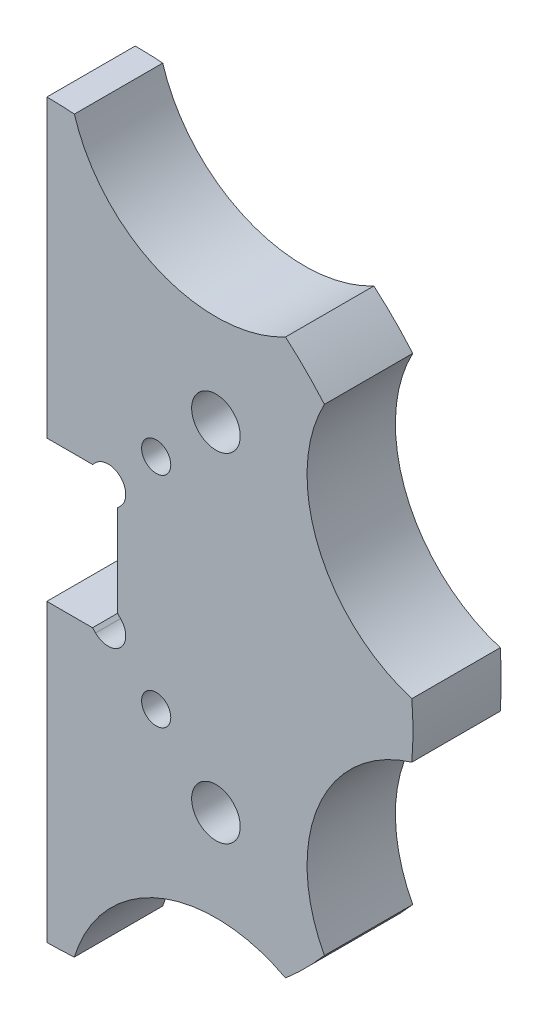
ISO-10303-21;
HEADER;
FILE_DESCRIPTION(('STEP AP214'),'2;1');
FILE_NAME('part.step','',(''),(''),'','','');
FILE_SCHEMA(('AUTOMOTIVE_DESIGN { 1 0 10303 214 1 1 1 1 }'));
ENDSEC;
DATA;
#1=APPLICATION_CONTEXT('core data for automotive mechanical design processes');
#2=APPLICATION_PROTOCOL_DEFINITION('international standard','automotive_design',2000,#1);
#3=PRODUCT_CONTEXT('',#1,'mechanical');
#4=PRODUCT('Part','Part','',(#3));
#5=PRODUCT_RELATED_PRODUCT_CATEGORY('part','',(#4));
#6=PRODUCT_DEFINITION_FORMATION('','',#4);
#7=PRODUCT_DEFINITION_CONTEXT('part definition',#1,'design');
#8=PRODUCT_DEFINITION('design','',#6,#7);
#9=PRODUCT_DEFINITION_SHAPE('','',#8);
#10=(LENGTH_UNIT() NAMED_UNIT(*) SI_UNIT(.MILLI.,.METRE.));
#11=(NAMED_UNIT(*) PLANE_ANGLE_UNIT() SI_UNIT($,.RADIAN.));
#12=(NAMED_UNIT(*) SI_UNIT($,.STERADIAN.) SOLID_ANGLE_UNIT());
#13=UNCERTAINTY_MEASURE_WITH_UNIT(LENGTH_MEASURE(1.E-05),#10,'distance_accuracy_value','');
#14=(GEOMETRIC_REPRESENTATION_CONTEXT(3) GLOBAL_UNCERTAINTY_ASSIGNED_CONTEXT((#13)) GLOBAL_UNIT_ASSIGNED_CONTEXT((#10,
#11,#12)) REPRESENTATION_CONTEXT('',''));
#15=CARTESIAN_POINT('',(0.,0.,0.));
#16=DIRECTION('',(0.,0.,1.));
#17=DIRECTION('',(1.,0.,0.));
#18=AXIS2_PLACEMENT_3D('',#15,#16,#17);
#19=CARTESIAN_POINT('',(0.,0.,10.));
#20=DIRECTION('',(0.,0.,1.));
#21=DIRECTION('',(1.,0.,0.));
#22=AXIS2_PLACEMENT_3D('',#19,#20,#21);
#23=PLANE('',#22);
#24=DIRECTION('',(0.707106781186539,-0.707106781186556,0.));
#25=VECTOR('',#24,1.);
#26=CARTESIAN_POINT('',(5.51543289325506,-8.34386001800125,10.));
#27=LINE('',#26,#25);
#28=CARTESIAN_POINT('',(5.17157287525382,-8.,10.));
#29=VERTEX_POINT('',#28);
#30=CARTESIAN_POINT('',(5.51543289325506,-8.34386001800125,10.));
#31=VERTEX_POINT('',#30);
#32=EDGE_CURVE('E192',#29,#31,#27,.T.);
#33=ORIENTED_EDGE('',*,*,#32,.F.);
#34=DIRECTION('',(-1.,0.,0.));
#35=VECTOR('',#34,1.);
#36=CARTESIAN_POINT('',(0.,-8.,10.));
#37=LINE('',#36,#35);
#38=CARTESIAN_POINT('',(0.,-8.,10.));
#39=VERTEX_POINT('',#38);
#40=EDGE_CURVE('E258',#29,#39,#37,.T.);
#41=ORIENTED_EDGE('',*,*,#40,.T.);
#42=DIRECTION('',(0.,-1.,0.));
#43=VECTOR('',#42,1.);
#44=CARTESIAN_POINT('',(0.,-8.,10.));
#45=LINE('',#44,#43);
#46=CARTESIAN_POINT('',(0.,-41.4241092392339,10.));
#47=VERTEX_POINT('',#46);
#48=EDGE_CURVE('E261',#39,#47,#45,.T.);
#49=ORIENTED_EDGE('',*,*,#48,.T.);
#50=CARTESIAN_POINT('',(0.,0.,10.));
#51=DIRECTION('',(0.,0.,1.));
#52=DIRECTION('',(1.,0.,0.));
#53=AXIS2_PLACEMENT_3D('',#50,#51,#52);
#54=CIRCLE('',#53,41.4241092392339);
#55=CARTESIAN_POINT('',(3.11294377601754,-41.3069777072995,10.));
#56=VERTEX_POINT('',#55);
#57=EDGE_CURVE('E263',#47,#56,#54,.T.);
#58=ORIENTED_EDGE('',*,*,#57,.T.);
#59=CARTESIAN_POINT('',(19.1341716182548,-46.1939766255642,10.));
#60=DIRECTION('',(0.,0.,-1.));
#61=DIRECTION('',(1.,0.,0.));
#62=AXIS2_PLACEMENT_3D('',#59,#60,#61);
#63=CIRCLE('',#62,16.75);
#64=CARTESIAN_POINT('',(27.0072603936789,-31.4096277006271,10.));
#65=VERTEX_POINT('',#64);
#66=EDGE_CURVE('E265',#56,#65,#63,.T.);
#67=ORIENTED_EDGE('',*,*,#66,.T.);
#68=CARTESIAN_POINT('',(0.,0.,10.));
#69=DIRECTION('',(0.,0.,1.));
#70=DIRECTION('',(1.,0.,0.));
#71=AXIS2_PLACEMENT_3D('',#68,#69,#70);
#72=CIRCLE('',#71,41.4241092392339);
#73=CARTESIAN_POINT('',(31.4096277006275,-27.0072603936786,10.));
#74=VERTEX_POINT('',#73);
#75=EDGE_CURVE('E267',#65,#74,#72,.T.);
#76=ORIENTED_EDGE('',*,*,#75,.T.);
#77=CARTESIAN_POINT('',(46.1939766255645,-19.1341716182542,10.));
#78=DIRECTION('',(0.,0.,-1.));
#79=DIRECTION('',(1.,0.,0.));
#80=AXIS2_PLACEMENT_3D('',#77,#78,#79);
#81=CIRCLE('',#80,16.75);
#82=CARTESIAN_POINT('',(41.3069777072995,-3.11294377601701,10.));
#83=VERTEX_POINT('',#82);
#84=EDGE_CURVE('E269',#74,#83,#81,.T.);
#85=ORIENTED_EDGE('',*,*,#84,.T.);
#86=CARTESIAN_POINT('',(0.,0.,10.));
#87=DIRECTION('',(0.,0.,1.));
#88=DIRECTION('',(1.,0.,0.));
#89=AXIS2_PLACEMENT_3D('',#86,#87,#88);
#90=CIRCLE('',#89,41.4241092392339);
#91=CARTESIAN_POINT('',(41.3069777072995,3.11294377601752,10.));
#92=VERTEX_POINT('',#91);
#93=EDGE_CURVE('E271',#83,#92,#90,.T.);
#94=ORIENTED_EDGE('',*,*,#93,.T.);
#95=CARTESIAN_POINT('',(46.1939766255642,19.1341716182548,10.));
#96=DIRECTION('',(0.,0.,-1.));
#97=DIRECTION('',(1.,0.,0.));
#98=AXIS2_PLACEMENT_3D('',#95,#96,#97);
#99=CIRCLE('',#98,16.75);
#100=CARTESIAN_POINT('',(31.4096277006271,27.0072603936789,10.));
#101=VERTEX_POINT('',#100);
#102=EDGE_CURVE('E273',#92,#101,#99,.T.);
#103=ORIENTED_EDGE('',*,*,#102,.T.);
#104=CARTESIAN_POINT('',(0.,0.,10.));
#105=DIRECTION('',(0.,0.,1.));
#106=DIRECTION('',(1.,0.,0.));
#107=AXIS2_PLACEMENT_3D('',#104,#105,#106);
#108=CIRCLE('',#107,41.4241092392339);
#109=CARTESIAN_POINT('',(27.0072603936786,31.4096277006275,10.));
#110=VERTEX_POINT('',#109);
#111=EDGE_CURVE('E275',#101,#110,#108,.T.);
#112=ORIENTED_EDGE('',*,*,#111,.T.);
#113=CARTESIAN_POINT('',(19.1341716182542,46.1939766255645,10.));
#114=DIRECTION('',(0.,0.,-1.));
#115=DIRECTION('',(1.,0.,0.));
#116=AXIS2_PLACEMENT_3D('',#113,#114,#115);
#117=CIRCLE('',#116,16.75);
#118=CARTESIAN_POINT('',(3.11294377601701,41.3069777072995,10.));
#119=VERTEX_POINT('',#118);
#120=EDGE_CURVE('E277',#110,#119,#117,.T.);
#121=ORIENTED_EDGE('',*,*,#120,.T.);
#122=CARTESIAN_POINT('',(0.,0.,10.));
#123=DIRECTION('',(0.,0.,1.));
#124=DIRECTION('',(1.,0.,0.));
#125=AXIS2_PLACEMENT_3D('',#122,#123,#124);
#126=CIRCLE('',#125,41.4241092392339);
#127=CARTESIAN_POINT('',(0.,41.4241092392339,10.));
#128=VERTEX_POINT('',#127);
#129=EDGE_CURVE('E279',#119,#128,#126,.T.);
#130=ORIENTED_EDGE('',*,*,#129,.T.);
#131=DIRECTION('',(0.,-1.,0.));
#132=VECTOR('',#131,1.);
#133=CARTESIAN_POINT('',(0.,41.4241092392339,10.));
#134=LINE('',#133,#132);
#135=CARTESIAN_POINT('',(0.,8.,10.));
#136=VERTEX_POINT('',#135);
#137=EDGE_CURVE('E281',#128,#136,#134,.T.);
#138=ORIENTED_EDGE('',*,*,#137,.T.);
#139=DIRECTION('',(1.,0.,0.));
#140=VECTOR('',#139,1.);
#141=CARTESIAN_POINT('',(0.,8.,10.));
#142=LINE('',#141,#140);
#143=CARTESIAN_POINT('',(5.17157287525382,8.,10.));
#144=VERTEX_POINT('',#143);
#145=EDGE_CURVE('E283',#136,#144,#142,.T.);
#146=ORIENTED_EDGE('',*,*,#145,.T.);
#147=DIRECTION('',(-0.707106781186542,-0.707106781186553,0.));
#148=VECTOR('',#147,1.);
#149=CARTESIAN_POINT('',(5.51543289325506,8.34386001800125,10.));
#150=LINE('',#149,#148);
#151=CARTESIAN_POINT('',(5.51543289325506,8.34386001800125,10.));
#152=VERTEX_POINT('',#151);
#153=EDGE_CURVE('E56',#152,#144,#150,.T.);
#154=ORIENTED_EDGE('',*,*,#153,.F.);
#155=CARTESIAN_POINT('',(6.92964645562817,6.92964645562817,10.));
#156=DIRECTION('',(0.,0.,1.));
#157=DIRECTION('',(1.,0.,0.));
#158=AXIS2_PLACEMENT_3D('',#155,#156,#157);
#159=CIRCLE('',#158,2.);
#160=CARTESIAN_POINT('',(8.34386001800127,5.51543289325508,10.));
#161=VERTEX_POINT('',#160);
#162=EDGE_CURVE('E203',#161,#152,#159,.T.);
#163=ORIENTED_EDGE('',*,*,#162,.F.);
#164=DIRECTION('',(0.707106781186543,0.707106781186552,0.));
#165=VECTOR('',#164,1.);
#166=CARTESIAN_POINT('',(8.34386001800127,5.51543289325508,10.));
#167=LINE('',#166,#165);
#168=CARTESIAN_POINT('',(8.00000000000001,5.17157287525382,10.));
#169=VERTEX_POINT('',#168);
#170=EDGE_CURVE('E211',#169,#161,#167,.T.);
#171=ORIENTED_EDGE('',*,*,#170,.F.);
#172=DIRECTION('',(0.,-1.,0.));
#173=VECTOR('',#172,1.);
#174=CARTESIAN_POINT('',(8.00000000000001,8.,10.));
#175=LINE('',#174,#173);
#176=CARTESIAN_POINT('',(8.00000000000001,-5.17157287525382,10.));
#177=VERTEX_POINT('',#176);
#178=EDGE_CURVE('E255',#169,#177,#175,.T.);
#179=ORIENTED_EDGE('',*,*,#178,.T.);
#180=DIRECTION('',(-0.707106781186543,0.707106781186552,0.));
#181=VECTOR('',#180,1.);
#182=CARTESIAN_POINT('',(8.34386001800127,-5.51543289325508,10.));
#183=LINE('',#182,#181);
#184=CARTESIAN_POINT('',(8.34386001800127,-5.51543289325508,10.));
#185=VERTEX_POINT('',#184);
#186=EDGE_CURVE('E195',#185,#177,#183,.T.);
#187=ORIENTED_EDGE('',*,*,#186,.F.);
#188=CARTESIAN_POINT('',(6.92964645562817,-6.92964645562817,10.));
#189=DIRECTION('',(0.,0.,1.));
#190=DIRECTION('',(-1.,0.,0.));
#191=AXIS2_PLACEMENT_3D('',#188,#189,#190);
#192=CIRCLE('',#191,2.);
#193=EDGE_CURVE('E176',#31,#185,#192,.T.);
#194=ORIENTED_EDGE('',*,*,#193,.F.);
#195=EDGE_LOOP('',(#33,#41,#49,#58,#67,#76,#85,#94,#103,#112,#121,#130,#138,#146,#154,#163,#171,
#179,#187,#194));
#196=FACE_BOUND('',#195,.T.);
#197=CARTESIAN_POINT('',(12.3743686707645,12.3743686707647,10.));
#198=DIRECTION('',(0.,0.,1.));
#199=DIRECTION('',(1.,0.,0.));
#200=AXIS2_PLACEMENT_3D('',#197,#198,#199);
#201=CIRCLE('',#200,1.65);
#202=CARTESIAN_POINT('',(14.0243686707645,12.3743686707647,10.));
#203=VERTEX_POINT('',#202);
#204=EDGE_CURVE('E225',#203,#203,#201,.T.);
#205=ORIENTED_EDGE('',*,*,#204,.F.);
#206=EDGE_LOOP('',(#205));
#207=FACE_BOUND('',#206,.T.);
#208=CARTESIAN_POINT('',(12.3743686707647,-12.3743686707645,10.));
#209=DIRECTION('',(0.,0.,1.));
#210=DIRECTION('',(1.,0.,0.));
#211=AXIS2_PLACEMENT_3D('',#208,#209,#210);
#212=CIRCLE('',#211,1.65);
#213=CARTESIAN_POINT('',(14.0243686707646,-12.3743686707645,10.));
#214=VERTEX_POINT('',#213);
#215=EDGE_CURVE('E236',#214,#214,#212,.T.);
#216=ORIENTED_EDGE('',*,*,#215,.F.);
#217=EDGE_LOOP('',(#216));
#218=FACE_BOUND('',#217,.T.);
#219=CARTESIAN_POINT('',(19.1341716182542,19.1341716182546,10.));
#220=DIRECTION('',(0.,0.,1.));
#221=DIRECTION('',(1.,0.,0.));
#222=AXIS2_PLACEMENT_3D('',#219,#220,#221);
#223=CIRCLE('',#222,2.75);
#224=CARTESIAN_POINT('',(21.8841716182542,19.1341716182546,10.));
#225=VERTEX_POINT('',#224);
#226=EDGE_CURVE('E249',#225,#225,#223,.T.);
#227=ORIENTED_EDGE('',*,*,#226,.F.);
#228=EDGE_LOOP('',(#227));
#229=FACE_BOUND('',#228,.T.);
#230=CARTESIAN_POINT('',(19.1341716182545,-19.1341716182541,10.));
#231=DIRECTION('',(0.,0.,1.));
#232=DIRECTION('',(1.,0.,0.));
#233=AXIS2_PLACEMENT_3D('',#230,#231,#232);
#234=CIRCLE('',#233,2.75);
#235=CARTESIAN_POINT('',(21.8841716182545,-19.1341716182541,10.));
#236=VERTEX_POINT('',#235);
#237=EDGE_CURVE('E243',#236,#236,#234,.T.);
#238=ORIENTED_EDGE('',*,*,#237,.F.);
#239=EDGE_LOOP('',(#238));
#240=FACE_BOUND('',#239,.T.);
#241=ADVANCED_FACE('F33',(#196,#207,#218,#229,#240),#23,.T.);
#242=CARTESIAN_POINT('',(0.,0.,0.));
#243=DIRECTION('',(0.,0.,1.));
#244=DIRECTION('',(1.,0.,0.));
#245=AXIS2_PLACEMENT_3D('',#242,#243,#244);
#246=PLANE('',#245);
#247=CARTESIAN_POINT('',(12.3743686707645,12.3743686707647,0.));
#248=DIRECTION('',(0.,0.,1.));
#249=DIRECTION('',(1.,0.,0.));
#250=AXIS2_PLACEMENT_3D('',#247,#248,#249);
#251=CIRCLE('',#250,1.65);
#252=CARTESIAN_POINT('',(14.0243686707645,12.3743686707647,0.));
#253=VERTEX_POINT('',#252);
#254=EDGE_CURVE('E233',#253,#253,#251,.T.);
#255=ORIENTED_EDGE('',*,*,#254,.T.);
#256=EDGE_LOOP('',(#255));
#257=FACE_BOUND('',#256,.T.);
#258=CARTESIAN_POINT('',(12.3743686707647,-12.3743686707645,0.));
#259=DIRECTION('',(0.,0.,1.));
#260=DIRECTION('',(1.,0.,0.));
#261=AXIS2_PLACEMENT_3D('',#258,#259,#260);
#262=CIRCLE('',#261,1.65);
#263=CARTESIAN_POINT('',(14.0243686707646,-12.3743686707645,0.));
#264=VERTEX_POINT('',#263);
#265=EDGE_CURVE('E239',#264,#264,#262,.T.);
#266=ORIENTED_EDGE('',*,*,#265,.T.);
#267=EDGE_LOOP('',(#266));
#268=FACE_BOUND('',#267,.T.);
#269=CARTESIAN_POINT('',(19.1341716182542,19.1341716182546,0.));
#270=DIRECTION('',(0.,0.,1.));
#271=DIRECTION('',(1.,0.,0.));
#272=AXIS2_PLACEMENT_3D('',#269,#270,#271);
#273=CIRCLE('',#272,2.75);
#274=CARTESIAN_POINT('',(21.8841716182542,19.1341716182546,0.));
#275=VERTEX_POINT('',#274);
#276=EDGE_CURVE('E246',#275,#275,#273,.T.);
#277=ORIENTED_EDGE('',*,*,#276,.T.);
#278=EDGE_LOOP('',(#277));
#279=FACE_BOUND('',#278,.T.);
#280=DIRECTION('',(-1.,0.,0.));
#281=VECTOR('',#280,1.);
#282=CARTESIAN_POINT('',(0.,-8.,0.));
#283=LINE('',#282,#281);
#284=CARTESIAN_POINT('',(5.17157287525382,-8.,0.));
#285=VERTEX_POINT('',#284);
#286=CARTESIAN_POINT('',(0.,-8.,0.));
#287=VERTEX_POINT('',#286);
#288=EDGE_CURVE('E288',#285,#287,#283,.T.);
#289=ORIENTED_EDGE('',*,*,#288,.F.);
#290=DIRECTION('',(0.707106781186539,-0.707106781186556,0.));
#291=VECTOR('',#290,1.);
#292=CARTESIAN_POINT('',(5.51543289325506,-8.34386001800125,0.));
#293=LINE('',#292,#291);
#294=CARTESIAN_POINT('',(5.51543289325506,-8.34386001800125,0.));
#295=VERTEX_POINT('',#294);
#296=EDGE_CURVE('E48',#285,#295,#293,.T.);
#297=ORIENTED_EDGE('',*,*,#296,.T.);
#298=CARTESIAN_POINT('',(6.92964645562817,-6.92964645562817,0.));
#299=DIRECTION('',(0.,0.,1.));
#300=DIRECTION('',(-1.,0.,0.));
#301=AXIS2_PLACEMENT_3D('',#298,#299,#300);
#302=CIRCLE('',#301,2.);
#303=CARTESIAN_POINT('',(8.34386001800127,-5.51543289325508,0.));
#304=VERTEX_POINT('',#303);
#305=EDGE_CURVE('E174',#295,#304,#302,.T.);
#306=ORIENTED_EDGE('',*,*,#305,.T.);
#307=DIRECTION('',(-0.707106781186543,0.707106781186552,0.));
#308=VECTOR('',#307,1.);
#309=CARTESIAN_POINT('',(8.34386001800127,-5.51543289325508,0.));
#310=LINE('',#309,#308);
#311=CARTESIAN_POINT('',(8.00000000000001,-5.17157287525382,0.));
#312=VERTEX_POINT('',#311);
#313=EDGE_CURVE('E182',#304,#312,#310,.T.);
#314=ORIENTED_EDGE('',*,*,#313,.T.);
#315=DIRECTION('',(0.,-1.,0.));
#316=VECTOR('',#315,1.);
#317=CARTESIAN_POINT('',(8.00000000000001,8.,0.));
#318=LINE('',#317,#316);
#319=CARTESIAN_POINT('',(8.00000000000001,5.17157287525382,0.));
#320=VERTEX_POINT('',#319);
#321=EDGE_CURVE('E252',#320,#312,#318,.T.);
#322=ORIENTED_EDGE('',*,*,#321,.F.);
#323=DIRECTION('',(0.707106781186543,0.707106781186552,0.));
#324=VECTOR('',#323,1.);
#325=CARTESIAN_POINT('',(8.34386001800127,5.51543289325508,0.));
#326=LINE('',#325,#324);
#327=CARTESIAN_POINT('',(8.34386001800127,5.51543289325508,0.));
#328=VERTEX_POINT('',#327);
#329=EDGE_CURVE('E214',#320,#328,#326,.T.);
#330=ORIENTED_EDGE('',*,*,#329,.T.);
#331=CARTESIAN_POINT('',(6.92964645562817,6.92964645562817,0.));
#332=DIRECTION('',(0.,0.,1.));
#333=DIRECTION('',(1.,0.,0.));
#334=AXIS2_PLACEMENT_3D('',#331,#332,#333);
#335=CIRCLE('',#334,2.);
#336=CARTESIAN_POINT('',(5.51543289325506,8.34386001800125,0.));
#337=VERTEX_POINT('',#336);
#338=EDGE_CURVE('E207',#328,#337,#335,.T.);
#339=ORIENTED_EDGE('',*,*,#338,.T.);
#340=DIRECTION('',(-0.707106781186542,-0.707106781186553,0.));
#341=VECTOR('',#340,1.);
#342=CARTESIAN_POINT('',(5.51543289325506,8.34386001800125,0.));
#343=LINE('',#342,#341);
#344=CARTESIAN_POINT('',(5.17157287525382,8.,0.));
#345=VERTEX_POINT('',#344);
#346=EDGE_CURVE('E210',#337,#345,#343,.T.);
#347=ORIENTED_EDGE('',*,*,#346,.T.);
#348=DIRECTION('',(1.,0.,0.));
#349=VECTOR('',#348,1.);
#350=CARTESIAN_POINT('',(0.,8.,0.));
#351=LINE('',#350,#349);
#352=CARTESIAN_POINT('',(0.,8.,0.));
#353=VERTEX_POINT('',#352);
#354=EDGE_CURVE('E259',#353,#345,#351,.T.);
#355=ORIENTED_EDGE('',*,*,#354,.F.);
#356=DIRECTION('',(0.,-1.,0.));
#357=VECTOR('',#356,1.);
#358=CARTESIAN_POINT('',(0.,41.4241092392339,0.));
#359=LINE('',#358,#357);
#360=CARTESIAN_POINT('',(0.,41.4241092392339,0.));
#361=VERTEX_POINT('',#360);
#362=EDGE_CURVE('E310',#361,#353,#359,.T.);
#363=ORIENTED_EDGE('',*,*,#362,.F.);
#364=CARTESIAN_POINT('',(0.,0.,0.));
#365=DIRECTION('',(0.,0.,1.));
#366=DIRECTION('',(1.,0.,0.));
#367=AXIS2_PLACEMENT_3D('',#364,#365,#366);
#368=CIRCLE('',#367,41.4241092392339);
#369=CARTESIAN_POINT('',(3.11294377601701,41.3069777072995,0.));
#370=VERTEX_POINT('',#369);
#371=EDGE_CURVE('E308',#370,#361,#368,.T.);
#372=ORIENTED_EDGE('',*,*,#371,.F.);
#373=CARTESIAN_POINT('',(19.1341716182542,46.1939766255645,0.));
#374=DIRECTION('',(0.,0.,-1.));
#375=DIRECTION('',(1.,0.,0.));
#376=AXIS2_PLACEMENT_3D('',#373,#374,#375);
#377=CIRCLE('',#376,16.75);
#378=CARTESIAN_POINT('',(27.0072603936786,31.4096277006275,0.));
#379=VERTEX_POINT('',#378);
#380=EDGE_CURVE('E306',#379,#370,#377,.T.);
#381=ORIENTED_EDGE('',*,*,#380,.F.);
#382=CARTESIAN_POINT('',(0.,0.,0.));
#383=DIRECTION('',(0.,0.,1.));
#384=DIRECTION('',(1.,0.,0.));
#385=AXIS2_PLACEMENT_3D('',#382,#383,#384);
#386=CIRCLE('',#385,41.4241092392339);
#387=CARTESIAN_POINT('',(31.4096277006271,27.0072603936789,0.));
#388=VERTEX_POINT('',#387);
#389=EDGE_CURVE('E304',#388,#379,#386,.T.);
#390=ORIENTED_EDGE('',*,*,#389,.F.);
#391=CARTESIAN_POINT('',(46.1939766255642,19.1341716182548,0.));
#392=DIRECTION('',(0.,0.,-1.));
#393=DIRECTION('',(1.,0.,0.));
#394=AXIS2_PLACEMENT_3D('',#391,#392,#393);
#395=CIRCLE('',#394,16.75);
#396=CARTESIAN_POINT('',(41.3069777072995,3.11294377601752,0.));
#397=VERTEX_POINT('',#396);
#398=EDGE_CURVE('E302',#397,#388,#395,.T.);
#399=ORIENTED_EDGE('',*,*,#398,.F.);
#400=CARTESIAN_POINT('',(0.,0.,0.));
#401=DIRECTION('',(0.,0.,1.));
#402=DIRECTION('',(1.,0.,0.));
#403=AXIS2_PLACEMENT_3D('',#400,#401,#402);
#404=CIRCLE('',#403,41.4241092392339);
#405=CARTESIAN_POINT('',(41.3069777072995,-3.11294377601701,0.));
#406=VERTEX_POINT('',#405);
#407=EDGE_CURVE('E300',#406,#397,#404,.T.);
#408=ORIENTED_EDGE('',*,*,#407,.F.);
#409=CARTESIAN_POINT('',(46.1939766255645,-19.1341716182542,0.));
#410=DIRECTION('',(0.,0.,-1.));
#411=DIRECTION('',(1.,0.,0.));
#412=AXIS2_PLACEMENT_3D('',#409,#410,#411);
#413=CIRCLE('',#412,16.75);
#414=CARTESIAN_POINT('',(31.4096277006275,-27.0072603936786,0.));
#415=VERTEX_POINT('',#414);
#416=EDGE_CURVE('E298',#415,#406,#413,.T.);
#417=ORIENTED_EDGE('',*,*,#416,.F.);
#418=CARTESIAN_POINT('',(0.,0.,0.));
#419=DIRECTION('',(0.,0.,1.));
#420=DIRECTION('',(1.,0.,0.));
#421=AXIS2_PLACEMENT_3D('',#418,#419,#420);
#422=CIRCLE('',#421,41.4241092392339);
#423=CARTESIAN_POINT('',(27.0072603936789,-31.4096277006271,0.));
#424=VERTEX_POINT('',#423);
#425=EDGE_CURVE('E296',#424,#415,#422,.T.);
#426=ORIENTED_EDGE('',*,*,#425,.F.);
#427=CARTESIAN_POINT('',(19.1341716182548,-46.1939766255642,0.));
#428=DIRECTION('',(0.,0.,-1.));
#429=DIRECTION('',(1.,0.,0.));
#430=AXIS2_PLACEMENT_3D('',#427,#428,#429);
#431=CIRCLE('',#430,16.75);
#432=CARTESIAN_POINT('',(3.11294377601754,-41.3069777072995,0.));
#433=VERTEX_POINT('',#432);
#434=EDGE_CURVE('E294',#433,#424,#431,.T.);
#435=ORIENTED_EDGE('',*,*,#434,.F.);
#436=CARTESIAN_POINT('',(0.,0.,0.));
#437=DIRECTION('',(0.,0.,1.));
#438=DIRECTION('',(1.,0.,0.));
#439=AXIS2_PLACEMENT_3D('',#436,#437,#438);
#440=CIRCLE('',#439,41.4241092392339);
#441=CARTESIAN_POINT('',(0.,-41.4241092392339,0.));
#442=VERTEX_POINT('',#441);
#443=EDGE_CURVE('E292',#442,#433,#440,.T.);
#444=ORIENTED_EDGE('',*,*,#443,.F.);
#445=DIRECTION('',(0.,-1.,0.));
#446=VECTOR('',#445,1.);
#447=CARTESIAN_POINT('',(0.,-8.,0.));
#448=LINE('',#447,#446);
#449=EDGE_CURVE('E290',#287,#442,#448,.T.);
#450=ORIENTED_EDGE('',*,*,#449,.F.);
#451=EDGE_LOOP('',(#289,#297,#306,#314,#322,#330,#339,#347,#355,#363,#372,#381,#390,#399,#408,
#417,#426,#435,#444,#450));
#452=FACE_BOUND('',#451,.T.);
#453=CARTESIAN_POINT('',(19.1341716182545,-19.1341716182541,0.));
#454=DIRECTION('',(0.,0.,1.));
#455=DIRECTION('',(1.,0.,0.));
#456=AXIS2_PLACEMENT_3D('',#453,#454,#455);
#457=CIRCLE('',#456,2.75);
#458=CARTESIAN_POINT('',(21.8841716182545,-19.1341716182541,0.));
#459=VERTEX_POINT('',#458);
#460=EDGE_CURVE('E242',#459,#459,#457,.T.);
#461=ORIENTED_EDGE('',*,*,#460,.T.);
#462=EDGE_LOOP('',(#461));
#463=FACE_BOUND('',#462,.T.);
#464=ADVANCED_FACE('F190',(#257,#268,#279,#452,#463),#246,.F.);
#465=CARTESIAN_POINT('',(8.00000000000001,8.,10.));
#466=DIRECTION('',(1.,0.,0.));
#467=DIRECTION('',(0.,1.,0.));
#468=AXIS2_PLACEMENT_3D('',#465,#466,#467);
#469=PLANE('',#468);
#470=ORIENTED_EDGE('',*,*,#321,.T.);
#471=DIRECTION('',(0.,0.,1.));
#472=VECTOR('',#471,1.);
#473=CARTESIAN_POINT('',(8.00000000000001,-5.17157287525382,0.));
#474=LINE('',#473,#472);
#475=EDGE_CURVE('E179',#312,#177,#474,.T.);
#476=ORIENTED_EDGE('',*,*,#475,.T.);
#477=ORIENTED_EDGE('',*,*,#178,.F.);
#478=DIRECTION('',(0.,0.,1.));
#479=VECTOR('',#478,1.);
#480=CARTESIAN_POINT('',(8.00000000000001,5.17157287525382,0.));
#481=LINE('',#480,#479);
#482=EDGE_CURVE('E226',#320,#169,#481,.T.);
#483=ORIENTED_EDGE('',*,*,#482,.F.);
#484=EDGE_LOOP('',(#470,#476,#477,#483));
#485=FACE_BOUND('',#484,.T.);
#486=ADVANCED_FACE('F35',(#485),#469,.F.);
#487=CARTESIAN_POINT('',(0.,-8.,10.));
#488=DIRECTION('',(0.,-1.,0.));
#489=DIRECTION('',(0.,0.,-1.));
#490=AXIS2_PLACEMENT_3D('',#487,#488,#489);
#491=PLANE('',#490);
#492=ORIENTED_EDGE('',*,*,#40,.F.);
#493=DIRECTION('',(0.,0.,1.));
#494=VECTOR('',#493,1.);
#495=CARTESIAN_POINT('',(5.17157287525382,-8.,0.));
#496=LINE('',#495,#494);
#497=EDGE_CURVE('E204',#285,#29,#496,.T.);
#498=ORIENTED_EDGE('',*,*,#497,.F.);
#499=ORIENTED_EDGE('',*,*,#288,.T.);
#500=DIRECTION('',(0.,0.,-1.));
#501=VECTOR('',#500,1.);
#502=CARTESIAN_POINT('',(0.,-8.,10.));
#503=LINE('',#502,#501);
#504=EDGE_CURVE('E11',#39,#287,#503,.T.);
#505=ORIENTED_EDGE('',*,*,#504,.F.);
#506=EDGE_LOOP('',(#492,#498,#499,#505));
#507=FACE_BOUND('',#506,.T.);
#508=ADVANCED_FACE('F372',(#507),#491,.F.);
#509=CARTESIAN_POINT('',(0.,-8.,10.));
#510=DIRECTION('',(1.,0.,0.));
#511=DIRECTION('',(0.,1.,0.));
#512=AXIS2_PLACEMENT_3D('',#509,#510,#511);
#513=PLANE('',#512);
#514=ORIENTED_EDGE('',*,*,#449,.T.);
#515=DIRECTION('',(0.,0.,-1.));
#516=VECTOR('',#515,1.);
#517=CARTESIAN_POINT('',(0.,-41.4241092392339,10.));
#518=LINE('',#517,#516);
#519=EDGE_CURVE('E41',#47,#442,#518,.T.);
#520=ORIENTED_EDGE('',*,*,#519,.F.);
#521=ORIENTED_EDGE('',*,*,#48,.F.);
#522=ORIENTED_EDGE('',*,*,#504,.T.);
#523=EDGE_LOOP('',(#514,#520,#521,#522));
#524=FACE_BOUND('',#523,.T.);
#525=ADVANCED_FACE('F370',(#524),#513,.F.);
#526=CARTESIAN_POINT('',(0.,0.,10.));
#527=DIRECTION('',(0.,0.,-1.));
#528=DIRECTION('',(-1.,0.,0.));
#529=AXIS2_PLACEMENT_3D('',#526,#527,#528);
#530=CYLINDRICAL_SURFACE('',#529,41.4241092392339);
#531=ORIENTED_EDGE('',*,*,#443,.T.);
#532=DIRECTION('',(0.,0.,-1.));
#533=VECTOR('',#532,1.);
#534=CARTESIAN_POINT('',(3.11294377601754,-41.3069777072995,10.));
#535=LINE('',#534,#533);
#536=EDGE_CURVE('E340',#56,#433,#535,.T.);
#537=ORIENTED_EDGE('',*,*,#536,.F.);
#538=ORIENTED_EDGE('',*,*,#57,.F.);
#539=ORIENTED_EDGE('',*,*,#519,.T.);
#540=EDGE_LOOP('',(#531,#537,#538,#539));
#541=FACE_BOUND('',#540,.T.);
#542=ADVANCED_FACE('F347',(#541),#530,.T.);
#543=CARTESIAN_POINT('',(19.1341716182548,-46.1939766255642,10.));
#544=DIRECTION('',(0.,0.,-1.));
#545=DIRECTION('',(-1.,0.,0.));
#546=AXIS2_PLACEMENT_3D('',#543,#544,#545);
#547=CYLINDRICAL_SURFACE('',#546,16.75);
#548=ORIENTED_EDGE('',*,*,#434,.T.);
#549=DIRECTION('',(0.,0.,-1.));
#550=VECTOR('',#549,1.);
#551=CARTESIAN_POINT('',(27.0072603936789,-31.4096277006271,10.));
#552=LINE('',#551,#550);
#553=EDGE_CURVE('E337',#65,#424,#552,.T.);
#554=ORIENTED_EDGE('',*,*,#553,.F.);
#555=ORIENTED_EDGE('',*,*,#66,.F.);
#556=ORIENTED_EDGE('',*,*,#536,.T.);
#557=EDGE_LOOP('',(#548,#554,#555,#556));
#558=FACE_BOUND('',#557,.T.);
#559=ADVANCED_FACE('F357',(#558),#547,.F.);
#560=CARTESIAN_POINT('',(0.,0.,10.));
#561=DIRECTION('',(0.,0.,-1.));
#562=DIRECTION('',(-1.,0.,0.));
#563=AXIS2_PLACEMENT_3D('',#560,#561,#562);
#564=CYLINDRICAL_SURFACE('',#563,41.4241092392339);
#565=ORIENTED_EDGE('',*,*,#425,.T.);
#566=DIRECTION('',(0.,0.,-1.));
#567=VECTOR('',#566,1.);
#568=CARTESIAN_POINT('',(31.4096277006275,-27.0072603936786,10.));
#569=LINE('',#568,#567);
#570=EDGE_CURVE('E334',#74,#415,#569,.T.);
#571=ORIENTED_EDGE('',*,*,#570,.F.);
#572=ORIENTED_EDGE('',*,*,#75,.F.);
#573=ORIENTED_EDGE('',*,*,#553,.T.);
#574=EDGE_LOOP('',(#565,#571,#572,#573));
#575=FACE_BOUND('',#574,.T.);
#576=ADVANCED_FACE('F361',(#575),#564,.T.);
#577=CARTESIAN_POINT('',(46.1939766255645,-19.1341716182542,10.));
#578=DIRECTION('',(0.,0.,-1.));
#579=DIRECTION('',(-1.,0.,0.));
#580=AXIS2_PLACEMENT_3D('',#577,#578,#579);
#581=CYLINDRICAL_SURFACE('',#580,16.75);
#582=ORIENTED_EDGE('',*,*,#416,.T.);
#583=DIRECTION('',(0.,0.,-1.));
#584=VECTOR('',#583,1.);
#585=CARTESIAN_POINT('',(41.3069777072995,-3.11294377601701,10.));
#586=LINE('',#585,#584);
#587=EDGE_CURVE('E331',#83,#406,#586,.T.);
#588=ORIENTED_EDGE('',*,*,#587,.F.);
#589=ORIENTED_EDGE('',*,*,#84,.F.);
#590=ORIENTED_EDGE('',*,*,#570,.T.);
#591=EDGE_LOOP('',(#582,#588,#589,#590));
#592=FACE_BOUND('',#591,.T.);
#593=ADVANCED_FACE('F421',(#592),#581,.F.);
#594=CARTESIAN_POINT('',(0.,0.,10.));
#595=DIRECTION('',(0.,0.,-1.));
#596=DIRECTION('',(-1.,0.,0.));
#597=AXIS2_PLACEMENT_3D('',#594,#595,#596);
#598=CYLINDRICAL_SURFACE('',#597,41.4241092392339);
#599=ORIENTED_EDGE('',*,*,#407,.T.);
#600=DIRECTION('',(0.,0.,-1.));
#601=VECTOR('',#600,1.);
#602=CARTESIAN_POINT('',(41.3069777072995,3.11294377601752,10.));
#603=LINE('',#602,#601);
#604=EDGE_CURVE('E328',#92,#397,#603,.T.);
#605=ORIENTED_EDGE('',*,*,#604,.F.);
#606=ORIENTED_EDGE('',*,*,#93,.F.);
#607=ORIENTED_EDGE('',*,*,#587,.T.);
#608=EDGE_LOOP('',(#599,#605,#606,#607));
#609=FACE_BOUND('',#608,.T.);
#610=ADVANCED_FACE('F419',(#609),#598,.T.);
#611=CARTESIAN_POINT('',(46.1939766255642,19.1341716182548,10.));
#612=DIRECTION('',(0.,0.,-1.));
#613=DIRECTION('',(-1.,0.,0.));
#614=AXIS2_PLACEMENT_3D('',#611,#612,#613);
#615=CYLINDRICAL_SURFACE('',#614,16.75);
#616=ORIENTED_EDGE('',*,*,#398,.T.);
#617=DIRECTION('',(0.,0.,-1.));
#618=VECTOR('',#617,1.);
#619=CARTESIAN_POINT('',(31.4096277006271,27.0072603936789,10.));
#620=LINE('',#619,#618);
#621=EDGE_CURVE('E325',#101,#388,#620,.T.);
#622=ORIENTED_EDGE('',*,*,#621,.F.);
#623=ORIENTED_EDGE('',*,*,#102,.F.);
#624=ORIENTED_EDGE('',*,*,#604,.T.);
#625=EDGE_LOOP('',(#616,#622,#623,#624));
#626=FACE_BOUND('',#625,.T.);
#627=ADVANCED_FACE('F414',(#626),#615,.F.);
#628=CARTESIAN_POINT('',(0.,0.,10.));
#629=DIRECTION('',(0.,0.,-1.));
#630=DIRECTION('',(-1.,0.,0.));
#631=AXIS2_PLACEMENT_3D('',#628,#629,#630);
#632=CYLINDRICAL_SURFACE('',#631,41.4241092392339);
#633=ORIENTED_EDGE('',*,*,#389,.T.);
#634=DIRECTION('',(0.,0.,-1.));
#635=VECTOR('',#634,1.);
#636=CARTESIAN_POINT('',(27.0072603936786,31.4096277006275,10.));
#637=LINE('',#636,#635);
#638=EDGE_CURVE('E322',#110,#379,#637,.T.);
#639=ORIENTED_EDGE('',*,*,#638,.F.);
#640=ORIENTED_EDGE('',*,*,#111,.F.);
#641=ORIENTED_EDGE('',*,*,#621,.T.);
#642=EDGE_LOOP('',(#633,#639,#640,#641));
#643=FACE_BOUND('',#642,.T.);
#644=ADVANCED_FACE('F409',(#643),#632,.T.);
#645=CARTESIAN_POINT('',(19.1341716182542,46.1939766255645,10.));
#646=DIRECTION('',(0.,0.,-1.));
#647=DIRECTION('',(-1.,0.,0.));
#648=AXIS2_PLACEMENT_3D('',#645,#646,#647);
#649=CYLINDRICAL_SURFACE('',#648,16.75);
#650=ORIENTED_EDGE('',*,*,#380,.T.);
#651=DIRECTION('',(0.,0.,-1.));
#652=VECTOR('',#651,1.);
#653=CARTESIAN_POINT('',(3.11294377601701,41.3069777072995,10.));
#654=LINE('',#653,#652);
#655=EDGE_CURVE('E319',#119,#370,#654,.T.);
#656=ORIENTED_EDGE('',*,*,#655,.F.);
#657=ORIENTED_EDGE('',*,*,#120,.F.);
#658=ORIENTED_EDGE('',*,*,#638,.T.);
#659=EDGE_LOOP('',(#650,#656,#657,#658));
#660=FACE_BOUND('',#659,.T.);
#661=ADVANCED_FACE('F405',(#660),#649,.F.);
#662=CARTESIAN_POINT('',(0.,0.,10.));
#663=DIRECTION('',(0.,0.,-1.));
#664=DIRECTION('',(-1.,0.,0.));
#665=AXIS2_PLACEMENT_3D('',#662,#663,#664);
#666=CYLINDRICAL_SURFACE('',#665,41.4241092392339);
#667=ORIENTED_EDGE('',*,*,#371,.T.);
#668=DIRECTION('',(0.,0.,-1.));
#669=VECTOR('',#668,1.);
#670=CARTESIAN_POINT('',(0.,41.4241092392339,10.));
#671=LINE('',#670,#669);
#672=EDGE_CURVE('E316',#128,#361,#671,.T.);
#673=ORIENTED_EDGE('',*,*,#672,.F.);
#674=ORIENTED_EDGE('',*,*,#129,.F.);
#675=ORIENTED_EDGE('',*,*,#655,.T.);
#676=EDGE_LOOP('',(#667,#673,#674,#675));
#677=FACE_BOUND('',#676,.T.);
#678=ADVANCED_FACE('F400',(#677),#666,.T.);
#679=CARTESIAN_POINT('',(0.,41.4241092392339,10.));
#680=DIRECTION('',(1.,0.,0.));
#681=DIRECTION('',(0.,1.,0.));
#682=AXIS2_PLACEMENT_3D('',#679,#680,#681);
#683=PLANE('',#682);
#684=ORIENTED_EDGE('',*,*,#362,.T.);
#685=DIRECTION('',(0.,0.,-1.));
#686=VECTOR('',#685,1.);
#687=CARTESIAN_POINT('',(0.,8.,10.));
#688=LINE('',#687,#686);
#689=EDGE_CURVE('E286',#136,#353,#688,.T.);
#690=ORIENTED_EDGE('',*,*,#689,.F.);
#691=ORIENTED_EDGE('',*,*,#137,.F.);
#692=ORIENTED_EDGE('',*,*,#672,.T.);
#693=EDGE_LOOP('',(#684,#690,#691,#692));
#694=FACE_BOUND('',#693,.T.);
#695=ADVANCED_FACE('F394',(#694),#683,.F.);
#696=CARTESIAN_POINT('',(0.,8.,10.));
#697=DIRECTION('',(0.,1.,0.));
#698=DIRECTION('',(0.,0.,1.));
#699=AXIS2_PLACEMENT_3D('',#696,#697,#698);
#700=PLANE('',#699);
#701=ORIENTED_EDGE('',*,*,#354,.T.);
#702=DIRECTION('',(0.,0.,1.));
#703=VECTOR('',#702,1.);
#704=CARTESIAN_POINT('',(5.17157287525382,8.,0.));
#705=LINE('',#704,#703);
#706=EDGE_CURVE('E228',#345,#144,#705,.T.);
#707=ORIENTED_EDGE('',*,*,#706,.T.);
#708=ORIENTED_EDGE('',*,*,#145,.F.);
#709=ORIENTED_EDGE('',*,*,#689,.T.);
#710=EDGE_LOOP('',(#701,#707,#708,#709));
#711=FACE_BOUND('',#710,.T.);
#712=ADVANCED_FACE('F389',(#711),#700,.F.);
#713=CARTESIAN_POINT('',(19.1341716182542,19.1341716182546,10.));
#714=DIRECTION('',(0.,0.,-1.));
#715=DIRECTION('',(-1.,0.,0.));
#716=AXIS2_PLACEMENT_3D('',#713,#714,#715);
#717=CYLINDRICAL_SURFACE('',#716,2.75);
#718=ORIENTED_EDGE('',*,*,#226,.T.);
#719=EDGE_LOOP('',(#718));
#720=FACE_BOUND('',#719,.T.);
#721=ORIENTED_EDGE('',*,*,#276,.F.);
#722=EDGE_LOOP('',(#721));
#723=FACE_BOUND('',#722,.T.);
#724=ADVANCED_FACE('F439',(#720,#723),#717,.F.);
#725=CARTESIAN_POINT('',(19.1341716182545,-19.1341716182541,10.));
#726=DIRECTION('',(0.,0.,-1.));
#727=DIRECTION('',(-1.,0.,0.));
#728=AXIS2_PLACEMENT_3D('',#725,#726,#727);
#729=CYLINDRICAL_SURFACE('',#728,2.75);
#730=ORIENTED_EDGE('',*,*,#237,.T.);
#731=EDGE_LOOP('',(#730));
#732=FACE_BOUND('',#731,.T.);
#733=ORIENTED_EDGE('',*,*,#460,.F.);
#734=EDGE_LOOP('',(#733));
#735=FACE_BOUND('',#734,.T.);
#736=ADVANCED_FACE('F488',(#732,#735),#729,.F.);
#737=CARTESIAN_POINT('',(12.3743686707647,-12.3743686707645,10.));
#738=DIRECTION('',(0.,0.,1.));
#739=DIRECTION('',(1.,0.,0.));
#740=AXIS2_PLACEMENT_3D('',#737,#738,#739);
#741=CYLINDRICAL_SURFACE('',#740,1.65);
#742=ORIENTED_EDGE('',*,*,#265,.F.);
#743=EDGE_LOOP('',(#742));
#744=FACE_BOUND('',#743,.T.);
#745=ORIENTED_EDGE('',*,*,#215,.T.);
#746=EDGE_LOOP('',(#745));
#747=FACE_BOUND('',#746,.T.);
#748=ADVANCED_FACE('F494',(#744,#747),#741,.F.);
#749=CARTESIAN_POINT('',(12.3743686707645,12.3743686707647,10.));
#750=DIRECTION('',(0.,0.,1.));
#751=DIRECTION('',(1.,0.,0.));
#752=AXIS2_PLACEMENT_3D('',#749,#750,#751);
#753=CYLINDRICAL_SURFACE('',#752,1.65);
#754=ORIENTED_EDGE('',*,*,#254,.F.);
#755=EDGE_LOOP('',(#754));
#756=FACE_BOUND('',#755,.T.);
#757=ORIENTED_EDGE('',*,*,#204,.T.);
#758=EDGE_LOOP('',(#757));
#759=FACE_BOUND('',#758,.T.);
#760=ADVANCED_FACE('F501',(#756,#759),#753,.F.);
#761=CARTESIAN_POINT('',(6.92964645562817,6.92964645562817,0.));
#762=DIRECTION('',(0.,0.,1.));
#763=DIRECTION('',(1.,0.,0.));
#764=AXIS2_PLACEMENT_3D('',#761,#762,#763);
#765=CYLINDRICAL_SURFACE('',#764,2.);
#766=ORIENTED_EDGE('',*,*,#162,.T.);
#767=DIRECTION('',(0.,0.,1.));
#768=VECTOR('',#767,1.);
#769=CARTESIAN_POINT('',(5.51543289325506,8.34386001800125,0.));
#770=LINE('',#769,#768);
#771=EDGE_CURVE('E217',#337,#152,#770,.T.);
#772=ORIENTED_EDGE('',*,*,#771,.F.);
#773=ORIENTED_EDGE('',*,*,#338,.F.);
#774=DIRECTION('',(0.,0.,1.));
#775=VECTOR('',#774,1.);
#776=CARTESIAN_POINT('',(8.34386001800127,5.51543289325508,0.));
#777=LINE('',#776,#775);
#778=EDGE_CURVE('E223',#328,#161,#777,.T.);
#779=ORIENTED_EDGE('',*,*,#778,.T.);
#780=EDGE_LOOP('',(#766,#772,#773,#779));
#781=FACE_BOUND('',#780,.T.);
#782=ADVANCED_FACE('F383',(#781),#765,.F.);
#783=CARTESIAN_POINT('',(8.34386001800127,5.51543289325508,0.));
#784=DIRECTION('',(0.707106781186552,-0.707106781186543,0.));
#785=DIRECTION('',(0.707106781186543,0.707106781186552,0.));
#786=AXIS2_PLACEMENT_3D('',#783,#784,#785);
#787=PLANE('',#786);
#788=ORIENTED_EDGE('',*,*,#170,.T.);
#789=ORIENTED_EDGE('',*,*,#778,.F.);
#790=ORIENTED_EDGE('',*,*,#329,.F.);
#791=ORIENTED_EDGE('',*,*,#482,.T.);
#792=EDGE_LOOP('',(#788,#789,#790,#791));
#793=FACE_BOUND('',#792,.T.);
#794=ADVANCED_FACE('F380',(#793),#787,.F.);
#795=CARTESIAN_POINT('',(5.51543289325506,8.34386001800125,0.));
#796=DIRECTION('',(-0.707106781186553,0.707106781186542,0.));
#797=DIRECTION('',(-0.707106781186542,-0.707106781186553,0.));
#798=AXIS2_PLACEMENT_3D('',#795,#796,#797);
#799=PLANE('',#798);
#800=ORIENTED_EDGE('',*,*,#153,.T.);
#801=ORIENTED_EDGE('',*,*,#706,.F.);
#802=ORIENTED_EDGE('',*,*,#346,.F.);
#803=ORIENTED_EDGE('',*,*,#771,.T.);
#804=EDGE_LOOP('',(#800,#801,#802,#803));
#805=FACE_BOUND('',#804,.T.);
#806=ADVANCED_FACE('F385',(#805),#799,.F.);
#807=CARTESIAN_POINT('',(6.92964645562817,-6.92964645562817,0.));
#808=DIRECTION('',(0.,0.,1.));
#809=DIRECTION('',(1.,0.,0.));
#810=AXIS2_PLACEMENT_3D('',#807,#808,#809);
#811=CYLINDRICAL_SURFACE('',#810,2.);
#812=ORIENTED_EDGE('',*,*,#193,.T.);
#813=DIRECTION('',(0.,0.,1.));
#814=VECTOR('',#813,1.);
#815=CARTESIAN_POINT('',(8.34386001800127,-5.51543289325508,0.));
#816=LINE('',#815,#814);
#817=EDGE_CURVE('E170',#304,#185,#816,.T.);
#818=ORIENTED_EDGE('',*,*,#817,.F.);
#819=ORIENTED_EDGE('',*,*,#305,.F.);
#820=DIRECTION('',(0.,0.,1.));
#821=VECTOR('',#820,1.);
#822=CARTESIAN_POINT('',(5.51543289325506,-8.34386001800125,0.));
#823=LINE('',#822,#821);
#824=EDGE_CURVE('E201',#295,#31,#823,.T.);
#825=ORIENTED_EDGE('',*,*,#824,.T.);
#826=EDGE_LOOP('',(#812,#818,#819,#825));
#827=FACE_BOUND('',#826,.T.);
#828=ADVANCED_FACE('F172',(#827),#811,.F.);
#829=CARTESIAN_POINT('',(5.51543289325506,-8.34386001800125,0.));
#830=DIRECTION('',(-0.707106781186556,-0.707106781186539,0.));
#831=DIRECTION('',(0.707106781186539,-0.707106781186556,0.));
#832=AXIS2_PLACEMENT_3D('',#829,#830,#831);
#833=PLANE('',#832);
#834=ORIENTED_EDGE('',*,*,#32,.T.);
#835=ORIENTED_EDGE('',*,*,#824,.F.);
#836=ORIENTED_EDGE('',*,*,#296,.F.);
#837=ORIENTED_EDGE('',*,*,#497,.T.);
#838=EDGE_LOOP('',(#834,#835,#836,#837));
#839=FACE_BOUND('',#838,.T.);
#840=ADVANCED_FACE('F373',(#839),#833,.F.);
#841=CARTESIAN_POINT('',(8.34386001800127,-5.51543289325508,0.));
#842=DIRECTION('',(0.707106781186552,0.707106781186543,0.));
#843=DIRECTION('',(-0.707106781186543,0.707106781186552,0.));
#844=AXIS2_PLACEMENT_3D('',#841,#842,#843);
#845=PLANE('',#844);
#846=ORIENTED_EDGE('',*,*,#186,.T.);
#847=ORIENTED_EDGE('',*,*,#475,.F.);
#848=ORIENTED_EDGE('',*,*,#313,.F.);
#849=ORIENTED_EDGE('',*,*,#817,.T.);
#850=EDGE_LOOP('',(#846,#847,#848,#849));
#851=FACE_BOUND('',#850,.T.);
#852=ADVANCED_FACE('F183',(#851),#845,.F.);
#853=CLOSED_SHELL('',(#241,#464,#486,#508,#525,#542,#559,#576,#593,#610,#627,#644,#661,#678,
#695,#712,#724,#736,#748,#760,#782,#794,#806,#828,#840,#852));
#854=MANIFOLD_SOLID_BREP('B2',#853);
#855=ADVANCED_BREP_SHAPE_REPRESENTATION('',(#18,#854),#14);
#856=SHAPE_DEFINITION_REPRESENTATION(#9,#855);
ENDSEC;
END-ISO-10303-21;
